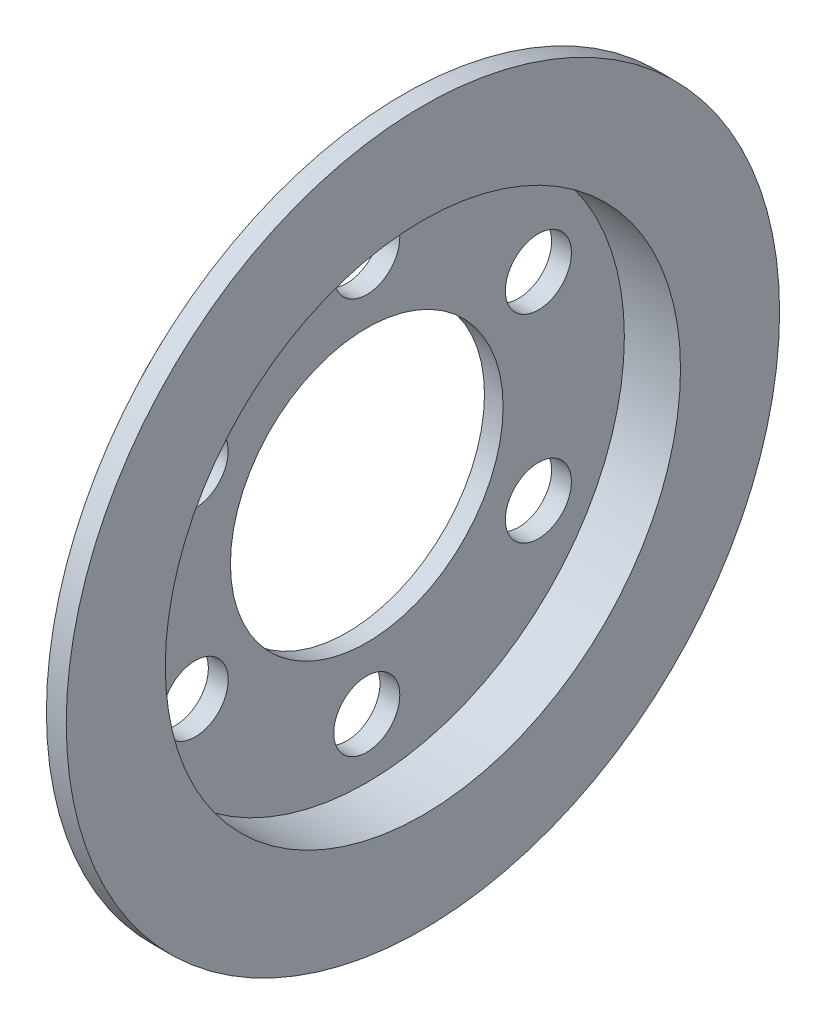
from build123d import *

# Parameters (mm, degrees)
SKETCH2_R          = 5
CUT_EXTRUDE1_DEPTH = 77.839117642


with BuildPart() as part:
    # Sketch1 → Revolve1 (revolve)
    with BuildSketch(Plane.XY, mode=Mode.PRIVATE) as revolve1_sk:
        Polygon((8, 20.82), (8, 42), (16.5, 42), (16.5, 54), (19.5, 54), (19.5, 39), (11, 39), (11, 20.64), align=None)
    revolve(revolve1_sk.sketch.rotate(Axis((-58.272844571, 0, 0), (1, 0, 0)), 90), axis=Axis((-58.272844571, 0, 0), (1, 0, 0)))

    # Sketch2 → Cut-Extrude1 (cut, through all)
    with BuildSketch(Plane(origin=(11, 0, 0), x_dir=(0, 0, -1), z_dir=(1, 0, 0))):
        with Locations((0, 30)):
            Circle(SKETCH2_R)
        with Locations((25.980762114, 15)):
            Circle(SKETCH2_R)
        with Locations((25.980762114, -15)):
            Circle(SKETCH2_R)
        with Locations((0, -30)):
            Circle(SKETCH2_R)
        with Locations((-25.980762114, -15)):
            Circle(SKETCH2_R)
        with Locations((-25.980762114, 15)):
            Circle(SKETCH2_R)
    extrude(amount=-CUT_EXTRUDE1_DEPTH, mode=Mode.SUBTRACT)


solid = part.part
